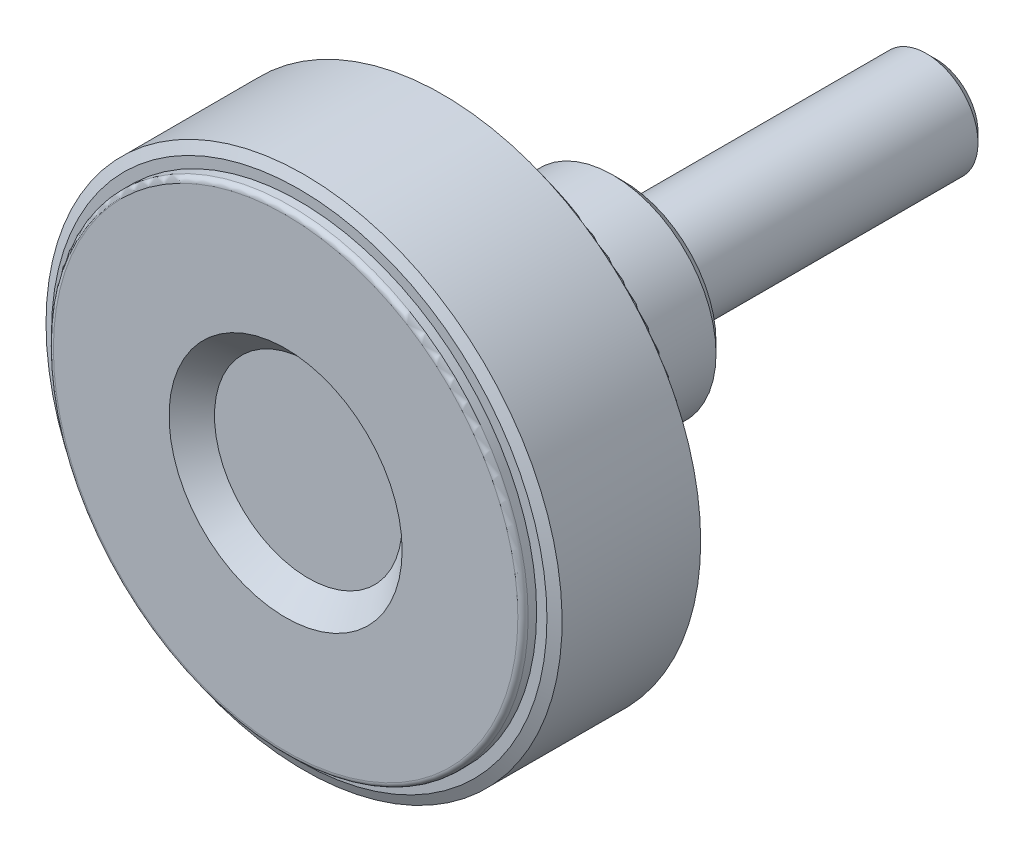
ISO-10303-21;
HEADER;
FILE_DESCRIPTION(('STEP AP214'),'2;1');
FILE_NAME('part.step','',(''),(''),'','','');
FILE_SCHEMA(('AUTOMOTIVE_DESIGN { 1 0 10303 214 1 1 1 1 }'));
ENDSEC;
DATA;
#1=APPLICATION_CONTEXT('core data for automotive mechanical design processes');
#2=APPLICATION_PROTOCOL_DEFINITION('international standard','automotive_design',2000,#1);
#3=PRODUCT_CONTEXT('',#1,'mechanical');
#4=PRODUCT('Part','Part','',(#3));
#5=PRODUCT_RELATED_PRODUCT_CATEGORY('part','',(#4));
#6=PRODUCT_DEFINITION_FORMATION('','',#4);
#7=PRODUCT_DEFINITION_CONTEXT('part definition',#1,'design');
#8=PRODUCT_DEFINITION('design','',#6,#7);
#9=PRODUCT_DEFINITION_SHAPE('','',#8);
#10=(LENGTH_UNIT() NAMED_UNIT(*) SI_UNIT(.MILLI.,.METRE.));
#11=(NAMED_UNIT(*) PLANE_ANGLE_UNIT() SI_UNIT($,.RADIAN.));
#12=(NAMED_UNIT(*) SI_UNIT($,.STERADIAN.) SOLID_ANGLE_UNIT());
#13=UNCERTAINTY_MEASURE_WITH_UNIT(LENGTH_MEASURE(1.E-05),#10,'distance_accuracy_value','');
#14=(GEOMETRIC_REPRESENTATION_CONTEXT(3) GLOBAL_UNCERTAINTY_ASSIGNED_CONTEXT((#13)) GLOBAL_UNIT_ASSIGNED_CONTEXT((#10,
#11,#12)) REPRESENTATION_CONTEXT('',''));
#15=CARTESIAN_POINT('',(0.,0.,0.));
#16=DIRECTION('',(0.,0.,1.));
#17=DIRECTION('',(1.,0.,0.));
#18=AXIS2_PLACEMENT_3D('',#15,#16,#17);
#19=CARTESIAN_POINT('',(0.,2.04,-30.));
#20=DIRECTION('',(0.,0.,-1.));
#21=DIRECTION('',(-1.,0.,0.));
#22=AXIS2_PLACEMENT_3D('',#19,#20,#21);
#23=PLANE('',#22);
#24=CARTESIAN_POINT('',(0.,0.,-29.9999999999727));
#25=DIRECTION('',(0.,0.,1.));
#26=DIRECTION('',(1.,0.,0.));
#27=AXIS2_PLACEMENT_3D('',#24,#25,#26);
#28=CIRCLE('',#27,4.07999999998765);
#29=CARTESIAN_POINT('',(4.07999999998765,0.,-29.9999999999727));
#30=VERTEX_POINT('',#29);
#31=EDGE_CURVE('E179',#30,#30,#28,.T.);
#32=ORIENTED_EDGE('',*,*,#31,.F.);
#33=EDGE_LOOP('',(#32));
#34=FACE_BOUND('',#33,.T.);
#35=ADVANCED_FACE('F14',(#34),#23,.T.);
#36=CARTESIAN_POINT('',(0.,0.,-29.0800000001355));
#37=DIRECTION('',(0.,0.,1.));
#38=DIRECTION('',(1.,0.,0.));
#39=AXIS2_PLACEMENT_3D('',#36,#37,#38);
#40=CONICAL_SURFACE('',#39,4.99999999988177,0.785398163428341);
#41=ORIENTED_EDGE('',*,*,#31,.T.);
#42=EDGE_LOOP('',(#41));
#43=FACE_BOUND('',#42,.T.);
#44=CARTESIAN_POINT('',(0.,0.,-29.08));
#45=DIRECTION('',(0.,0.,1.));
#46=DIRECTION('',(1.,0.,0.));
#47=AXIS2_PLACEMENT_3D('',#44,#45,#46);
#48=CIRCLE('',#47,5.);
#49=CARTESIAN_POINT('',(5.,0.,-29.08));
#50=VERTEX_POINT('',#49);
#51=EDGE_CURVE('E176',#50,#50,#48,.T.);
#52=ORIENTED_EDGE('',*,*,#51,.F.);
#53=EDGE_LOOP('',(#52));
#54=FACE_BOUND('',#53,.T.);
#55=ADVANCED_FACE('F536',(#43,#54),#40,.T.);
#56=CARTESIAN_POINT('',(0.,0.,-14.04));
#57=DIRECTION('',(0.,0.,1.));
#58=DIRECTION('',(1.,0.,0.));
#59=AXIS2_PLACEMENT_3D('',#56,#57,#58);
#60=CYLINDRICAL_SURFACE('',#59,5.);
#61=ORIENTED_EDGE('',*,*,#51,.T.);
#62=EDGE_LOOP('',(#61));
#63=FACE_BOUND('',#62,.T.);
#64=CARTESIAN_POINT('',(0.,0.,0.));
#65=DIRECTION('',(0.,0.,1.));
#66=DIRECTION('',(1.,0.,0.));
#67=AXIS2_PLACEMENT_3D('',#64,#65,#66);
#68=CIRCLE('',#67,5.);
#69=CARTESIAN_POINT('',(5.,0.,0.));
#70=VERTEX_POINT('',#69);
#71=EDGE_CURVE('E178',#70,#70,#68,.T.);
#72=ORIENTED_EDGE('',*,*,#71,.F.);
#73=EDGE_LOOP('',(#72));
#74=FACE_BOUND('',#73,.T.);
#75=ADVANCED_FACE('F526',(#63,#74),#60,.T.);
#76=CARTESIAN_POINT('',(0.,3.33333333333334,0.));
#77=DIRECTION('',(0.,0.,-1.));
#78=DIRECTION('',(-1.,0.,0.));
#79=AXIS2_PLACEMENT_3D('',#76,#77,#78);
#80=PLANE('',#79);
#81=CARTESIAN_POINT('',(0.,0.,0.));
#82=DIRECTION('',(0.,0.,1.));
#83=DIRECTION('',(1.,0.,0.));
#84=AXIS2_PLACEMENT_3D('',#81,#82,#83);
#85=CIRCLE('',#84,6.66666666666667);
#86=CARTESIAN_POINT('',(6.66666666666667,0.,0.));
#87=VERTEX_POINT('',#86);
#88=EDGE_CURVE('E211',#87,#87,#85,.T.);
#89=ORIENTED_EDGE('',*,*,#88,.F.);
#90=EDGE_LOOP('',(#89));
#91=FACE_BOUND('',#90,.T.);
#92=ORIENTED_EDGE('',*,*,#71,.T.);
#93=EDGE_LOOP('',(#92));
#94=FACE_BOUND('',#93,.T.);
#95=ADVANCED_FACE('F516',(#91,#94),#80,.T.);
#96=CARTESIAN_POINT('',(0.,0.,0.15));
#97=DIRECTION('',(0.,0.,1.));
#98=DIRECTION('',(1.,0.,0.));
#99=AXIS2_PLACEMENT_3D('',#96,#97,#98);
#100=CYLINDRICAL_SURFACE('',#99,6.66666666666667);
#101=ORIENTED_EDGE('',*,*,#88,.T.);
#102=EDGE_LOOP('',(#101));
#103=FACE_BOUND('',#102,.T.);
#104=CARTESIAN_POINT('',(0.,0.,0.3));
#105=DIRECTION('',(0.,0.,1.));
#106=DIRECTION('',(1.,0.,0.));
#107=AXIS2_PLACEMENT_3D('',#104,#105,#106);
#108=CIRCLE('',#107,6.66666666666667);
#109=CARTESIAN_POINT('',(6.66666666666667,0.,0.3));
#110=VERTEX_POINT('',#109);
#111=EDGE_CURVE('E208',#110,#110,#108,.T.);
#112=ORIENTED_EDGE('',*,*,#111,.F.);
#113=EDGE_LOOP('',(#112));
#114=FACE_BOUND('',#113,.T.);
#115=ADVANCED_FACE('F506',(#103,#114),#100,.T.);
#116=CARTESIAN_POINT('',(0.,7.83333333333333,0.3));
#117=DIRECTION('',(0.,0.,-1.));
#118=DIRECTION('',(-1.,0.,0.));
#119=AXIS2_PLACEMENT_3D('',#116,#117,#118);
#120=PLANE('',#119);
#121=CARTESIAN_POINT('',(0.,0.,0.3));
#122=DIRECTION('',(0.,0.,1.));
#123=DIRECTION('',(1.,0.,0.));
#124=AXIS2_PLACEMENT_3D('',#121,#122,#123);
#125=CIRCLE('',#124,9.);
#126=CARTESIAN_POINT('',(9.,0.,0.3));
#127=VERTEX_POINT('',#126);
#128=EDGE_CURVE('E175',#127,#127,#125,.T.);
#129=ORIENTED_EDGE('',*,*,#128,.F.);
#130=EDGE_LOOP('',(#129));
#131=FACE_BOUND('',#130,.T.);
#132=ORIENTED_EDGE('',*,*,#111,.T.);
#133=EDGE_LOOP('',(#132));
#134=FACE_BOUND('',#133,.T.);
#135=ADVANCED_FACE('F496',(#131,#134),#120,.T.);
#136=CARTESIAN_POINT('',(0.,0.,1.3));
#137=DIRECTION('',(0.,0.,1.));
#138=DIRECTION('',(1.,0.,0.));
#139=AXIS2_PLACEMENT_3D('',#136,#137,#138);
#140=CONICAL_SURFACE('',#139,10.,0.785398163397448);
#141=ORIENTED_EDGE('',*,*,#128,.T.);
#142=EDGE_LOOP('',(#141));
#143=FACE_BOUND('',#142,.T.);
#144=CARTESIAN_POINT('',(0.,0.,1.3));
#145=DIRECTION('',(0.,0.,1.));
#146=DIRECTION('',(1.,0.,0.));
#147=AXIS2_PLACEMENT_3D('',#144,#145,#146);
#148=CIRCLE('',#147,10.);
#149=CARTESIAN_POINT('',(10.,0.,1.3));
#150=VERTEX_POINT('',#149);
#151=EDGE_CURVE('E172',#150,#150,#148,.T.);
#152=ORIENTED_EDGE('',*,*,#151,.F.);
#153=EDGE_LOOP('',(#152));
#154=FACE_BOUND('',#153,.T.);
#155=ADVANCED_FACE('F487',(#143,#154),#140,.T.);
#156=CARTESIAN_POINT('',(0.,0.,13.9));
#157=DIRECTION('',(0.,0.,1.));
#158=DIRECTION('',(1.,0.,0.));
#159=AXIS2_PLACEMENT_3D('',#156,#157,#158);
#160=CYLINDRICAL_SURFACE('',#159,10.);
#161=ORIENTED_EDGE('',*,*,#151,.T.);
#162=EDGE_LOOP('',(#161));
#163=FACE_BOUND('',#162,.T.);
#164=CARTESIAN_POINT('',(0.,0.,26.5));
#165=DIRECTION('',(0.,0.,-1.));
#166=DIRECTION('',(-1.,0.,0.));
#167=AXIS2_PLACEMENT_3D('',#164,#165,#166);
#168=CIRCLE('',#167,10.);
#169=CARTESIAN_POINT('',(-10.,0.,26.5));
#170=VERTEX_POINT('',#169);
#171=EDGE_CURVE('E75',#170,#170,#168,.T.);
#172=ORIENTED_EDGE('',*,*,#171,.T.);
#173=EDGE_LOOP('',(#172));
#174=FACE_BOUND('',#173,.T.);
#175=ADVANCED_FACE('F482',(#163,#174),#160,.T.);
#176=CARTESIAN_POINT('',(0.,0.,26.5));
#177=DIRECTION('',(0.,0.,-1.));
#178=DIRECTION('',(-1.,0.,0.));
#179=AXIS2_PLACEMENT_3D('',#176,#177,#178);
#180=TOROIDAL_SURFACE('',#179,11.,1.);
#181=CARTESIAN_POINT('',(0.,0.,27.5));
#182=DIRECTION('',(0.,0.,-1.));
#183=DIRECTION('',(1.,0.,0.));
#184=AXIS2_PLACEMENT_3D('',#181,#182,#183);
#185=CIRCLE('',#184,11.);
#186=CARTESIAN_POINT('',(-11.,0.,27.5));
#187=VERTEX_POINT('',#186);
#188=CARTESIAN_POINT('',(11.,0.,27.5));
#189=VERTEX_POINT('',#188);
#190=EDGE_CURVE('E68',#187,#189,#185,.F.);
#191=ORIENTED_EDGE('',*,*,#190,.F.);
#192=CARTESIAN_POINT('',(0.,0.,27.5));
#193=DIRECTION('',(0.,0.,-1.));
#194=DIRECTION('',(-1.,0.,0.));
#195=AXIS2_PLACEMENT_3D('',#192,#193,#194);
#196=CIRCLE('',#195,11.);
#197=CARTESIAN_POINT('',(0.,11.,27.5));
#198=VERTEX_POINT('',#197);
#199=EDGE_CURVE('E71',#198,#187,#196,.F.);
#200=ORIENTED_EDGE('',*,*,#199,.F.);
#201=CARTESIAN_POINT('',(0.,0.,27.5));
#202=DIRECTION('',(0.,0.,-1.));
#203=DIRECTION('',(0.,1.,0.));
#204=AXIS2_PLACEMENT_3D('',#201,#202,#203);
#205=CIRCLE('',#204,11.);
#206=EDGE_CURVE('E63',#189,#198,#205,.F.);
#207=ORIENTED_EDGE('',*,*,#206,.F.);
#208=EDGE_LOOP('',(#191,#200,#207));
#209=FACE_BOUND('',#208,.T.);
#210=ORIENTED_EDGE('',*,*,#171,.F.);
#211=EDGE_LOOP('',(#210));
#212=FACE_BOUND('',#211,.T.);
#213=ADVANCED_FACE('F66',(#209,#212),#180,.F.);
#214=CARTESIAN_POINT('',(0.,14.6153846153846,27.5));
#215=DIRECTION('',(0.,0.,-1.));
#216=DIRECTION('',(-1.,0.,0.));
#217=AXIS2_PLACEMENT_3D('',#214,#215,#216);
#218=PLANE('',#217);
#219=CARTESIAN_POINT('',(0.,0.,27.5));
#220=DIRECTION('',(0.,0.,1.));
#221=DIRECTION('',(-1.,0.,0.));
#222=AXIS2_PLACEMENT_3D('',#219,#220,#221);
#223=CIRCLE('',#222,18.2307692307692);
#224=CARTESIAN_POINT('',(18.2307692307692,0.,27.5));
#225=VERTEX_POINT('',#224);
#226=CARTESIAN_POINT('',(-18.2307692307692,0.,27.5));
#227=VERTEX_POINT('',#226);
#228=EDGE_CURVE('E81',#225,#227,#223,.F.);
#229=ORIENTED_EDGE('',*,*,#228,.T.);
#230=CARTESIAN_POINT('',(0.,0.,27.5));
#231=DIRECTION('',(0.,0.,1.));
#232=DIRECTION('',(0.,1.,0.));
#233=AXIS2_PLACEMENT_3D('',#230,#231,#232);
#234=CIRCLE('',#233,18.2307692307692);
#235=CARTESIAN_POINT('',(0.,18.2307692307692,27.5));
#236=VERTEX_POINT('',#235);
#237=EDGE_CURVE('E130',#227,#236,#234,.F.);
#238=ORIENTED_EDGE('',*,*,#237,.T.);
#239=CARTESIAN_POINT('',(0.,0.,27.5));
#240=DIRECTION('',(0.,0.,1.));
#241=DIRECTION('',(1.,0.,0.));
#242=AXIS2_PLACEMENT_3D('',#239,#240,#241);
#243=CIRCLE('',#242,18.2307692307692);
#244=EDGE_CURVE('E143',#236,#225,#243,.F.);
#245=ORIENTED_EDGE('',*,*,#244,.T.);
#246=EDGE_LOOP('',(#229,#238,#245));
#247=FACE_BOUND('',#246,.T.);
#248=ORIENTED_EDGE('',*,*,#199,.T.);
#249=ORIENTED_EDGE('',*,*,#190,.T.);
#250=ORIENTED_EDGE('',*,*,#206,.T.);
#251=EDGE_LOOP('',(#248,#249,#250));
#252=FACE_BOUND('',#251,.T.);
#253=ADVANCED_FACE('F79',(#247,#252),#218,.T.);
#254=CARTESIAN_POINT('',(0.,0.,26.5));
#255=DIRECTION('',(0.,0.,-1.));
#256=DIRECTION('',(-1.,0.,0.));
#257=AXIS2_PLACEMENT_3D('',#254,#255,#256);
#258=TOROIDAL_SURFACE('',#257,18.2307692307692,1.);
#259=ORIENTED_EDGE('',*,*,#237,.F.);
#260=ORIENTED_EDGE('',*,*,#228,.F.);
#261=ORIENTED_EDGE('',*,*,#244,.F.);
#262=EDGE_LOOP('',(#259,#260,#261));
#263=FACE_BOUND('',#262,.T.);
#264=CARTESIAN_POINT('',(0.,0.,26.5));
#265=DIRECTION('',(0.,0.,1.));
#266=DIRECTION('',(1.,0.,0.));
#267=AXIS2_PLACEMENT_3D('',#264,#265,#266);
#268=CIRCLE('',#267,19.2307692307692);
#269=CARTESIAN_POINT('',(19.2307692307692,0.,26.5));
#270=VERTEX_POINT('',#269);
#271=EDGE_CURVE('E205',#270,#270,#268,.F.);
#272=ORIENTED_EDGE('',*,*,#271,.T.);
#273=EDGE_LOOP('',(#272));
#274=FACE_BOUND('',#273,.T.);
#275=ADVANCED_FACE('F100',(#263,#274),#258,.F.);
#276=CARTESIAN_POINT('',(0.,0.,21.25));
#277=DIRECTION('',(0.,0.,1.));
#278=DIRECTION('',(1.,0.,0.));
#279=AXIS2_PLACEMENT_3D('',#276,#277,#278);
#280=CYLINDRICAL_SURFACE('',#279,19.2307692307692);
#281=ORIENTED_EDGE('',*,*,#271,.F.);
#282=EDGE_LOOP('',(#281));
#283=FACE_BOUND('',#282,.T.);
#284=CARTESIAN_POINT('',(0.,0.,16.));
#285=DIRECTION('',(0.,0.,1.));
#286=DIRECTION('',(1.,0.,0.));
#287=AXIS2_PLACEMENT_3D('',#284,#285,#286);
#288=CIRCLE('',#287,19.2307692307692);
#289=CARTESIAN_POINT('',(19.2307692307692,0.,16.));
#290=VERTEX_POINT('',#289);
#291=EDGE_CURVE('E201',#290,#290,#288,.T.);
#292=ORIENTED_EDGE('',*,*,#291,.F.);
#293=EDGE_LOOP('',(#292));
#294=FACE_BOUND('',#293,.T.);
#295=ADVANCED_FACE('F329',(#283,#294),#280,.F.);
#296=CARTESIAN_POINT('',(0.,20.8653846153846,16.));
#297=DIRECTION('',(0.,0.,-1.));
#298=DIRECTION('',(-1.,0.,0.));
#299=AXIS2_PLACEMENT_3D('',#296,#297,#298);
#300=PLANE('',#299);
#301=CARTESIAN_POINT('',(0.,0.,16.));
#302=DIRECTION('',(0.,0.,1.));
#303=DIRECTION('',(-1.,0.,0.));
#304=AXIS2_PLACEMENT_3D('',#301,#302,#303);
#305=CIRCLE('',#304,22.5);
#306=CARTESIAN_POINT('',(-22.5,0.,16.));
#307=VERTEX_POINT('',#306);
#308=CARTESIAN_POINT('',(22.5,0.,16.));
#309=VERTEX_POINT('',#308);
#310=EDGE_CURVE('E264',#307,#309,#305,.T.);
#311=ORIENTED_EDGE('',*,*,#310,.F.);
#312=CARTESIAN_POINT('',(0.,0.,16.));
#313=DIRECTION('',(0.,0.,1.));
#314=DIRECTION('',(0.,1.,0.));
#315=AXIS2_PLACEMENT_3D('',#312,#313,#314);
#316=CIRCLE('',#315,22.5);
#317=CARTESIAN_POINT('',(0.,22.5,16.));
#318=VERTEX_POINT('',#317);
#319=EDGE_CURVE('E299',#318,#307,#316,.T.);
#320=ORIENTED_EDGE('',*,*,#319,.F.);
#321=CARTESIAN_POINT('',(0.,0.,16.));
#322=DIRECTION('',(0.,0.,1.));
#323=DIRECTION('',(1.,0.,0.));
#324=AXIS2_PLACEMENT_3D('',#321,#322,#323);
#325=CIRCLE('',#324,22.5);
#326=EDGE_CURVE('E204',#309,#318,#325,.T.);
#327=ORIENTED_EDGE('',*,*,#326,.F.);
#328=EDGE_LOOP('',(#311,#320,#327));
#329=FACE_BOUND('',#328,.T.);
#330=ORIENTED_EDGE('',*,*,#291,.T.);
#331=EDGE_LOOP('',(#330));
#332=FACE_BOUND('',#331,.T.);
#333=ADVANCED_FACE('F275',(#329,#332),#300,.T.);
#334=CARTESIAN_POINT('',(0.,0.,16.5));
#335=DIRECTION('',(0.,0.,-1.));
#336=DIRECTION('',(-1.,0.,0.));
#337=AXIS2_PLACEMENT_3D('',#334,#335,#336);
#338=TOROIDAL_SURFACE('',#337,22.5,0.5);
#339=ORIENTED_EDGE('',*,*,#319,.T.);
#340=ORIENTED_EDGE('',*,*,#310,.T.);
#341=ORIENTED_EDGE('',*,*,#326,.T.);
#342=EDGE_LOOP('',(#339,#340,#341));
#343=FACE_BOUND('',#342,.T.);
#344=CARTESIAN_POINT('',(0.,0.,16.5));
#345=DIRECTION('',(0.,0.,1.));
#346=DIRECTION('',(1.,0.,0.));
#347=AXIS2_PLACEMENT_3D('',#344,#345,#346);
#348=CIRCLE('',#347,23.);
#349=CARTESIAN_POINT('',(23.,0.,16.5));
#350=VERTEX_POINT('',#349);
#351=EDGE_CURVE('E200',#350,#350,#348,.T.);
#352=ORIENTED_EDGE('',*,*,#351,.F.);
#353=EDGE_LOOP('',(#352));
#354=FACE_BOUND('',#353,.T.);
#355=ADVANCED_FACE('F269',(#343,#354),#338,.T.);
#356=CARTESIAN_POINT('',(0.,0.,16.91));
#357=DIRECTION('',(0.,0.,1.));
#358=DIRECTION('',(1.,0.,0.));
#359=AXIS2_PLACEMENT_3D('',#356,#357,#358);
#360=CYLINDRICAL_SURFACE('',#359,23.);
#361=ORIENTED_EDGE('',*,*,#351,.T.);
#362=EDGE_LOOP('',(#361));
#363=FACE_BOUND('',#362,.T.);
#364=CARTESIAN_POINT('',(0.,0.,17.32));
#365=DIRECTION('',(0.,0.,1.));
#366=DIRECTION('',(1.,0.,0.));
#367=AXIS2_PLACEMENT_3D('',#364,#365,#366);
#368=CIRCLE('',#367,23.);
#369=CARTESIAN_POINT('',(23.,0.,17.32));
#370=VERTEX_POINT('',#369);
#371=EDGE_CURVE('E197',#370,#370,#368,.T.);
#372=ORIENTED_EDGE('',*,*,#371,.F.);
#373=EDGE_LOOP('',(#372));
#374=FACE_BOUND('',#373,.T.);
#375=ADVANCED_FACE('F274',(#363,#374),#360,.T.);
#376=CARTESIAN_POINT('',(0.,23.5,17.32));
#377=DIRECTION('',(0.,0.,-1.));
#378=DIRECTION('',(-1.,0.,0.));
#379=AXIS2_PLACEMENT_3D('',#376,#377,#378);
#380=PLANE('',#379);
#381=CARTESIAN_POINT('',(0.,0.,17.32));
#382=DIRECTION('',(0.,0.,1.));
#383=DIRECTION('',(1.,0.,0.));
#384=AXIS2_PLACEMENT_3D('',#381,#382,#383);
#385=CIRCLE('',#384,24.);
#386=CARTESIAN_POINT('',(24.,0.,17.32));
#387=VERTEX_POINT('',#386);
#388=EDGE_CURVE('E193',#387,#387,#385,.T.);
#389=ORIENTED_EDGE('',*,*,#388,.F.);
#390=EDGE_LOOP('',(#389));
#391=FACE_BOUND('',#390,.T.);
#392=ORIENTED_EDGE('',*,*,#371,.T.);
#393=EDGE_LOOP('',(#392));
#394=FACE_BOUND('',#393,.T.);
#395=ADVANCED_FACE('F342',(#391,#394),#380,.T.);
#396=CARTESIAN_POINT('',(0.,0.,17.786307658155));
#397=DIRECTION('',(0.,0.,1.));
#398=DIRECTION('',(1.,0.,0.));
#399=AXIS2_PLACEMENT_3D('',#396,#397,#398);
#400=CONICAL_SURFACE('',#399,25.,1.13446401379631);
#401=CARTESIAN_POINT('',(4.86721773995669E-13,1.73372427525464E-12,17.786307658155));
#402=DIRECTION('',(0.,0.,-1.));
#403=DIRECTION('',(-1.,0.,0.));
#404=AXIS2_PLACEMENT_3D('',#401,#402,#403);
#405=CIRCLE('',#404,24.9999999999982);
#406=CARTESIAN_POINT('',(-24.9999999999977,1.73372427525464E-12,17.786307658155));
#407=VERTEX_POINT('',#406);
#408=EDGE_CURVE('E196',#407,#407,#405,.F.);
#409=ORIENTED_EDGE('',*,*,#408,.F.);
#410=EDGE_LOOP('',(#409));
#411=FACE_BOUND('',#410,.T.);
#412=ORIENTED_EDGE('',*,*,#388,.T.);
#413=EDGE_LOOP('',(#412));
#414=FACE_BOUND('',#413,.T.);
#415=ADVANCED_FACE('F340',(#411,#414),#400,.T.);
#416=CARTESIAN_POINT('',(0.,4.54545454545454,30.8));
#417=DIRECTION('',(0.,0.,1.));
#418=DIRECTION('',(1.,0.,0.));
#419=AXIS2_PLACEMENT_3D('',#416,#417,#418);
#420=PLANE('',#419);
#421=CARTESIAN_POINT('',(0.,0.,30.8));
#422=DIRECTION('',(0.,0.,1.));
#423=DIRECTION('',(1.,0.,0.));
#424=AXIS2_PLACEMENT_3D('',#421,#422,#423);
#425=CIRCLE('',#424,9.0909090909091);
#426=CARTESIAN_POINT('',(9.0909090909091,0.,30.8));
#427=VERTEX_POINT('',#426);
#428=EDGE_CURVE('E181',#427,#427,#425,.T.);
#429=ORIENTED_EDGE('',*,*,#428,.T.);
#430=EDGE_LOOP('',(#429));
#431=FACE_BOUND('',#430,.T.);
#432=ADVANCED_FACE('F242',(#431),#420,.T.);
#433=CARTESIAN_POINT('',(0.,0.,33.));
#434=DIRECTION('',(0.,0.,1.));
#435=DIRECTION('',(1.,0.,0.));
#436=AXIS2_PLACEMENT_3D('',#433,#434,#435);
#437=CONICAL_SURFACE('',#436,11.2909090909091,0.785398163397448);
#438=CARTESIAN_POINT('',(0.,0.,33.));
#439=DIRECTION('',(0.,0.,1.));
#440=DIRECTION('',(1.,0.,0.));
#441=AXIS2_PLACEMENT_3D('',#438,#439,#440);
#442=CIRCLE('',#441,11.2909090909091);
#443=CARTESIAN_POINT('',(11.2909090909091,0.,33.));
#444=VERTEX_POINT('',#443);
#445=EDGE_CURVE('E9',#444,#444,#442,.F.);
#446=ORIENTED_EDGE('',*,*,#445,.F.);
#447=EDGE_LOOP('',(#446));
#448=FACE_BOUND('',#447,.T.);
#449=ORIENTED_EDGE('',*,*,#428,.F.);
#450=EDGE_LOOP('',(#449));
#451=FACE_BOUND('',#450,.T.);
#452=ADVANCED_FACE('F240',(#448,#451),#437,.F.);
#453=CARTESIAN_POINT('',(0.,16.8954545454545,33.));
#454=DIRECTION('',(0.,0.,1.));
#455=DIRECTION('',(1.,0.,0.));
#456=AXIS2_PLACEMENT_3D('',#453,#454,#455);
#457=PLANE('',#456);
#458=ORIENTED_EDGE('',*,*,#445,.T.);
#459=EDGE_LOOP('',(#458));
#460=FACE_BOUND('',#459,.T.);
#461=CARTESIAN_POINT('',(0.,0.,33.));
#462=DIRECTION('',(0.,0.,-1.));
#463=DIRECTION('',(-1.,0.,0.));
#464=AXIS2_PLACEMENT_3D('',#461,#462,#463);
#465=CIRCLE('',#464,22.5);
#466=CARTESIAN_POINT('',(0.,22.5,33.));
#467=VERTEX_POINT('',#466);
#468=CARTESIAN_POINT('',(-22.5,0.,33.));
#469=VERTEX_POINT('',#468);
#470=EDGE_CURVE('E219',#467,#469,#465,.F.);
#471=ORIENTED_EDGE('',*,*,#470,.T.);
#472=CARTESIAN_POINT('',(0.,0.,33.));
#473=DIRECTION('',(0.,0.,-1.));
#474=DIRECTION('',(1.,0.,0.));
#475=AXIS2_PLACEMENT_3D('',#472,#473,#474);
#476=CIRCLE('',#475,22.5);
#477=CARTESIAN_POINT('',(22.5,0.,33.));
#478=VERTEX_POINT('',#477);
#479=EDGE_CURVE('E23',#469,#478,#476,.F.);
#480=ORIENTED_EDGE('',*,*,#479,.T.);
#481=CARTESIAN_POINT('',(0.,0.,33.));
#482=DIRECTION('',(0.,0.,-1.));
#483=DIRECTION('',(0.,1.,0.));
#484=AXIS2_PLACEMENT_3D('',#481,#482,#483);
#485=CIRCLE('',#484,22.5);
#486=EDGE_CURVE('E184',#478,#467,#485,.F.);
#487=ORIENTED_EDGE('',*,*,#486,.T.);
#488=EDGE_LOOP('',(#471,#480,#487));
#489=FACE_BOUND('',#488,.T.);
#490=ADVANCED_FACE('F238',(#460,#489),#457,.T.);
#491=CARTESIAN_POINT('',(0.,0.,32.5));
#492=DIRECTION('',(0.,0.,-1.));
#493=DIRECTION('',(-1.,0.,0.));
#494=AXIS2_PLACEMENT_3D('',#491,#492,#493);
#495=TOROIDAL_SURFACE('',#494,22.5,0.5);
#496=CARTESIAN_POINT('',(0.,0.,32.5));
#497=DIRECTION('',(0.,0.,-1.));
#498=DIRECTION('',(-1.,0.,0.));
#499=AXIS2_PLACEMENT_3D('',#496,#497,#498);
#500=CIRCLE('',#499,23.);
#501=CARTESIAN_POINT('',(-23.,0.,32.5));
#502=VERTEX_POINT('',#501);
#503=EDGE_CURVE('E185',#502,#502,#500,.F.);
#504=ORIENTED_EDGE('',*,*,#503,.T.);
#505=EDGE_LOOP('',(#504));
#506=FACE_BOUND('',#505,.T.);
#507=ORIENTED_EDGE('',*,*,#479,.F.);
#508=ORIENTED_EDGE('',*,*,#470,.F.);
#509=ORIENTED_EDGE('',*,*,#486,.F.);
#510=EDGE_LOOP('',(#507,#508,#509));
#511=FACE_BOUND('',#510,.T.);
#512=ADVANCED_FACE('F226',(#506,#511),#495,.T.);
#513=CARTESIAN_POINT('',(0.,0.,32.09));
#514=DIRECTION('',(0.,0.,1.));
#515=DIRECTION('',(1.,0.,0.));
#516=AXIS2_PLACEMENT_3D('',#513,#514,#515);
#517=CYLINDRICAL_SURFACE('',#516,23.);
#518=ORIENTED_EDGE('',*,*,#503,.F.);
#519=EDGE_LOOP('',(#518));
#520=FACE_BOUND('',#519,.T.);
#521=CARTESIAN_POINT('',(0.,0.,31.68));
#522=DIRECTION('',(0.,0.,1.));
#523=DIRECTION('',(1.,0.,0.));
#524=AXIS2_PLACEMENT_3D('',#521,#522,#523);
#525=CIRCLE('',#524,23.);
#526=CARTESIAN_POINT('',(23.,0.,31.68));
#527=VERTEX_POINT('',#526);
#528=EDGE_CURVE('E186',#527,#527,#525,.T.);
#529=ORIENTED_EDGE('',*,*,#528,.T.);
#530=EDGE_LOOP('',(#529));
#531=FACE_BOUND('',#530,.T.);
#532=ADVANCED_FACE('F237',(#520,#531),#517,.T.);
#533=CARTESIAN_POINT('',(0.,0.,31.213692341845));
#534=DIRECTION('',(0.,0.,-1.));
#535=DIRECTION('',(-1.,0.,0.));
#536=AXIS2_PLACEMENT_3D('',#533,#534,#535);
#537=CONICAL_SURFACE('',#536,25.,1.13446401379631);
#538=CARTESIAN_POINT('',(0.,0.,31.68));
#539=DIRECTION('',(0.,0.,-1.));
#540=DIRECTION('',(-1.,0.,0.));
#541=AXIS2_PLACEMENT_3D('',#538,#539,#540);
#542=CIRCLE('',#541,24.);
#543=CARTESIAN_POINT('',(-24.,0.,31.68));
#544=VERTEX_POINT('',#543);
#545=EDGE_CURVE('E189',#544,#544,#542,.F.);
#546=ORIENTED_EDGE('',*,*,#545,.F.);
#547=EDGE_LOOP('',(#546));
#548=FACE_BOUND('',#547,.T.);
#549=CARTESIAN_POINT('',(0.,0.,31.213692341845));
#550=DIRECTION('',(0.,0.,-1.));
#551=DIRECTION('',(0.,1.,0.));
#552=AXIS2_PLACEMENT_3D('',#549,#550,#551);
#553=CIRCLE('',#552,25.);
#554=CARTESIAN_POINT('',(0.,25.,31.213692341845));
#555=VERTEX_POINT('',#554);
#556=EDGE_CURVE('E192',#555,#555,#553,.F.);
#557=ORIENTED_EDGE('',*,*,#556,.T.);
#558=EDGE_LOOP('',(#557));
#559=FACE_BOUND('',#558,.T.);
#560=ADVANCED_FACE('F360',(#548,#559),#537,.T.);
#561=CARTESIAN_POINT('',(0.,23.5,31.68));
#562=DIRECTION('',(0.,0.,1.));
#563=DIRECTION('',(1.,0.,0.));
#564=AXIS2_PLACEMENT_3D('',#561,#562,#563);
#565=PLANE('',#564);
#566=ORIENTED_EDGE('',*,*,#528,.F.);
#567=EDGE_LOOP('',(#566));
#568=FACE_BOUND('',#567,.T.);
#569=ORIENTED_EDGE('',*,*,#545,.T.);
#570=EDGE_LOOP('',(#569));
#571=FACE_BOUND('',#570,.T.);
#572=ADVANCED_FACE('F358',(#568,#571),#565,.T.);
#573=CARTESIAN_POINT('',(4.86721773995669E-13,1.73372427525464E-12,0.));
#574=DIRECTION('',(0.,0.,-1.));
#575=DIRECTION('',(-1.,0.,0.));
#576=AXIS2_PLACEMENT_3D('',#573,#574,#575);
#577=CYLINDRICAL_SURFACE('',#576,24.9999999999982);
#578=ORIENTED_EDGE('',*,*,#408,.T.);
#579=EDGE_LOOP('',(#578));
#580=FACE_BOUND('',#579,.T.);
#581=ORIENTED_EDGE('',*,*,#556,.F.);
#582=EDGE_LOOP('',(#581));
#583=FACE_BOUND('',#582,.T.);
#584=ADVANCED_FACE('F355',(#580,#583),#577,.T.);
#585=CLOSED_SHELL('',(#35,#55,#75,#95,#115,#135,#155,#175,#213,#253,#275,#295,#333,#355,#375,
#395,#415,#432,#452,#490,#512,#532,#560,#572,#584));
#586=MANIFOLD_SOLID_BREP('B1',#585);
#587=ADVANCED_BREP_SHAPE_REPRESENTATION('',(#18,#586),#14);
#588=SHAPE_DEFINITION_REPRESENTATION(#9,#587);
ENDSEC;
END-ISO-10303-21;
